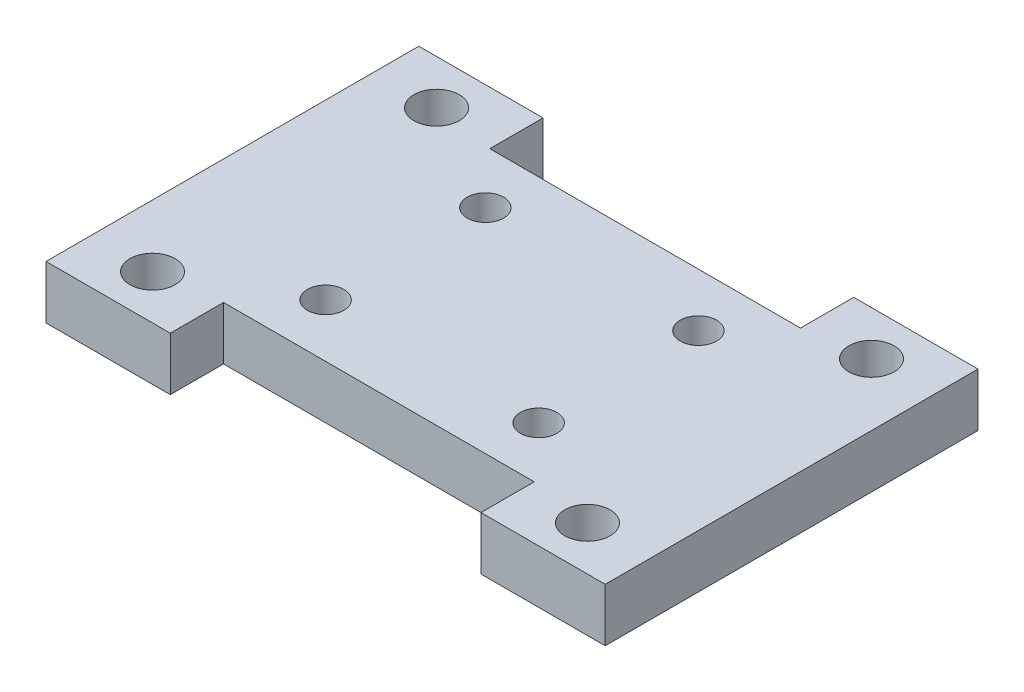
ISO-10303-21;
HEADER;
FILE_DESCRIPTION(('STEP AP214'),'2;1');
FILE_NAME('part.step','',(''),(''),'','','');
FILE_SCHEMA(('AUTOMOTIVE_DESIGN { 1 0 10303 214 1 1 1 1 }'));
ENDSEC;
DATA;
#1=APPLICATION_CONTEXT('core data for automotive mechanical design processes');
#2=APPLICATION_PROTOCOL_DEFINITION('international standard','automotive_design',2000,#1);
#3=PRODUCT_CONTEXT('',#1,'mechanical');
#4=PRODUCT('Part','Part','',(#3));
#5=PRODUCT_RELATED_PRODUCT_CATEGORY('part','',(#4));
#6=PRODUCT_DEFINITION_FORMATION('','',#4);
#7=PRODUCT_DEFINITION_CONTEXT('part definition',#1,'design');
#8=PRODUCT_DEFINITION('design','',#6,#7);
#9=PRODUCT_DEFINITION_SHAPE('','',#8);
#10=(LENGTH_UNIT() NAMED_UNIT(*) SI_UNIT(.MILLI.,.METRE.));
#11=(NAMED_UNIT(*) PLANE_ANGLE_UNIT() SI_UNIT($,.RADIAN.));
#12=(NAMED_UNIT(*) SI_UNIT($,.STERADIAN.) SOLID_ANGLE_UNIT());
#13=UNCERTAINTY_MEASURE_WITH_UNIT(LENGTH_MEASURE(1.E-05),#10,'distance_accuracy_value','');
#14=(GEOMETRIC_REPRESENTATION_CONTEXT(3) GLOBAL_UNCERTAINTY_ASSIGNED_CONTEXT((#13)) GLOBAL_UNIT_ASSIGNED_CONTEXT((#10,
#11,#12)) REPRESENTATION_CONTEXT('',''));
#15=CARTESIAN_POINT('',(0.,0.,0.));
#16=DIRECTION('',(0.,0.,1.));
#17=DIRECTION('',(1.,0.,0.));
#18=AXIS2_PLACEMENT_3D('',#15,#16,#17);
#19=CARTESIAN_POINT('',(0.,6.,0.));
#20=DIRECTION('',(0.,-1.,0.));
#21=DIRECTION('',(0.,0.,-1.));
#22=AXIS2_PLACEMENT_3D('',#19,#20,#21);
#23=PLANE('',#22);
#24=DIRECTION('',(0.,0.,1.));
#25=VECTOR('',#24,1.);
#26=CARTESIAN_POINT('',(17.5,6.,-15.));
#27=LINE('',#26,#25);
#28=CARTESIAN_POINT('',(17.5,6.,-21.));
#29=VERTEX_POINT('',#28);
#30=CARTESIAN_POINT('',(17.5,6.,-15.));
#31=VERTEX_POINT('',#30);
#32=EDGE_CURVE('E185',#29,#31,#27,.T.);
#33=ORIENTED_EDGE('',*,*,#32,.T.);
#34=DIRECTION('',(-1.,0.,0.));
#35=VECTOR('',#34,1.);
#36=CARTESIAN_POINT('',(-17.5,6.,-15.));
#37=LINE('',#36,#35);
#38=CARTESIAN_POINT('',(-17.5,6.,-15.));
#39=VERTEX_POINT('',#38);
#40=EDGE_CURVE('E113',#31,#39,#37,.T.);
#41=ORIENTED_EDGE('',*,*,#40,.T.);
#42=DIRECTION('',(0.,0.,-1.));
#43=VECTOR('',#42,1.);
#44=CARTESIAN_POINT('',(-17.5,6.,-15.));
#45=LINE('',#44,#43);
#46=CARTESIAN_POINT('',(-17.5,6.,-21.));
#47=VERTEX_POINT('',#46);
#48=EDGE_CURVE('E212',#39,#47,#45,.T.);
#49=ORIENTED_EDGE('',*,*,#48,.T.);
#50=DIRECTION('',(-1.,0.,0.));
#51=VECTOR('',#50,1.);
#52=CARTESIAN_POINT('',(-17.5,6.,-21.));
#53=LINE('',#52,#51);
#54=CARTESIAN_POINT('',(-31.5,6.,-21.));
#55=VERTEX_POINT('',#54);
#56=EDGE_CURVE('E231',#47,#55,#53,.T.);
#57=ORIENTED_EDGE('',*,*,#56,.T.);
#58=DIRECTION('',(0.,0.,1.));
#59=VECTOR('',#58,1.);
#60=CARTESIAN_POINT('',(-31.5,6.,-21.));
#61=LINE('',#60,#59);
#62=CARTESIAN_POINT('',(-31.5,6.,21.));
#63=VERTEX_POINT('',#62);
#64=EDGE_CURVE('E228',#55,#63,#61,.T.);
#65=ORIENTED_EDGE('',*,*,#64,.T.);
#66=DIRECTION('',(1.,0.,0.));
#67=VECTOR('',#66,1.);
#68=CARTESIAN_POINT('',(-31.5,6.,21.));
#69=LINE('',#68,#67);
#70=CARTESIAN_POINT('',(-17.5,6.,21.));
#71=VERTEX_POINT('',#70);
#72=EDGE_CURVE('E230',#63,#71,#69,.T.);
#73=ORIENTED_EDGE('',*,*,#72,.T.);
#74=DIRECTION('',(0.,0.,-1.));
#75=VECTOR('',#74,1.);
#76=CARTESIAN_POINT('',(-17.5,6.,21.));
#77=LINE('',#76,#75);
#78=CARTESIAN_POINT('',(-17.5,6.,15.));
#79=VERTEX_POINT('',#78);
#80=EDGE_CURVE('E233',#71,#79,#77,.T.);
#81=ORIENTED_EDGE('',*,*,#80,.T.);
#82=DIRECTION('',(1.,0.,0.));
#83=VECTOR('',#82,1.);
#84=CARTESIAN_POINT('',(-17.5,6.,15.));
#85=LINE('',#84,#83);
#86=CARTESIAN_POINT('',(17.5,6.,15.));
#87=VERTEX_POINT('',#86);
#88=EDGE_CURVE('E239',#79,#87,#85,.T.);
#89=ORIENTED_EDGE('',*,*,#88,.T.);
#90=DIRECTION('',(0.,0.,1.));
#91=VECTOR('',#90,1.);
#92=CARTESIAN_POINT('',(17.5,6.,21.));
#93=LINE('',#92,#91);
#94=CARTESIAN_POINT('',(17.5,6.,21.));
#95=VERTEX_POINT('',#94);
#96=EDGE_CURVE('E144',#87,#95,#93,.T.);
#97=ORIENTED_EDGE('',*,*,#96,.T.);
#98=DIRECTION('',(1.,0.,0.));
#99=VECTOR('',#98,1.);
#100=CARTESIAN_POINT('',(31.5,6.,21.));
#101=LINE('',#100,#99);
#102=CARTESIAN_POINT('',(31.5,6.,21.));
#103=VERTEX_POINT('',#102);
#104=EDGE_CURVE('E138',#95,#103,#101,.T.);
#105=ORIENTED_EDGE('',*,*,#104,.T.);
#106=DIRECTION('',(0.,0.,-1.));
#107=VECTOR('',#106,1.);
#108=CARTESIAN_POINT('',(31.5,6.,-21.));
#109=LINE('',#108,#107);
#110=CARTESIAN_POINT('',(31.5,6.,-21.));
#111=VERTEX_POINT('',#110);
#112=EDGE_CURVE('E142',#103,#111,#109,.T.);
#113=ORIENTED_EDGE('',*,*,#112,.T.);
#114=DIRECTION('',(-1.,0.,0.));
#115=VECTOR('',#114,1.);
#116=CARTESIAN_POINT('',(17.5,6.,-21.));
#117=LINE('',#116,#115);
#118=EDGE_CURVE('E58',#111,#29,#117,.T.);
#119=ORIENTED_EDGE('',*,*,#118,.T.);
#120=EDGE_LOOP('',(#33,#41,#49,#57,#65,#73,#81,#89,#97,#105,#113,#119));
#121=FACE_BOUND('',#120,.T.);
#122=CARTESIAN_POINT('',(-12.,6.,-9.));
#123=DIRECTION('',(0.,1.,0.));
#124=DIRECTION('',(0.,0.,1.));
#125=AXIS2_PLACEMENT_3D('',#122,#123,#124);
#126=CIRCLE('',#125,2.05);
#127=CARTESIAN_POINT('',(-12.,6.,-6.95));
#128=VERTEX_POINT('',#127);
#129=EDGE_CURVE('E166',#128,#128,#126,.T.);
#130=ORIENTED_EDGE('',*,*,#129,.F.);
#131=EDGE_LOOP('',(#130));
#132=FACE_BOUND('',#131,.T.);
#133=CARTESIAN_POINT('',(12.,6.,-9.));
#134=DIRECTION('',(0.,1.,0.));
#135=DIRECTION('',(0.,0.,-1.));
#136=AXIS2_PLACEMENT_3D('',#133,#134,#135);
#137=CIRCLE('',#136,2.05);
#138=CARTESIAN_POINT('',(12.,6.,-11.05));
#139=VERTEX_POINT('',#138);
#140=EDGE_CURVE('E343',#139,#139,#137,.T.);
#141=ORIENTED_EDGE('',*,*,#140,.F.);
#142=EDGE_LOOP('',(#141));
#143=FACE_BOUND('',#142,.T.);
#144=CARTESIAN_POINT('',(12.,6.,9.00000000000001));
#145=DIRECTION('',(0.,1.,0.));
#146=DIRECTION('',(0.,0.,1.));
#147=AXIS2_PLACEMENT_3D('',#144,#145,#146);
#148=CIRCLE('',#147,2.05);
#149=CARTESIAN_POINT('',(12.,6.,11.05));
#150=VERTEX_POINT('',#149);
#151=EDGE_CURVE('E337',#150,#150,#148,.T.);
#152=ORIENTED_EDGE('',*,*,#151,.F.);
#153=EDGE_LOOP('',(#152));
#154=FACE_BOUND('',#153,.T.);
#155=CARTESIAN_POINT('',(-12.,6.,9.));
#156=DIRECTION('',(0.,1.,0.));
#157=DIRECTION('',(0.,0.,-1.));
#158=AXIS2_PLACEMENT_3D('',#155,#156,#157);
#159=CIRCLE('',#158,2.05);
#160=CARTESIAN_POINT('',(-12.,6.,6.95));
#161=VERTEX_POINT('',#160);
#162=EDGE_CURVE('E331',#161,#161,#159,.T.);
#163=ORIENTED_EDGE('',*,*,#162,.F.);
#164=EDGE_LOOP('',(#163));
#165=FACE_BOUND('',#164,.T.);
#166=CARTESIAN_POINT('',(24.5,6.,-16.));
#167=DIRECTION('',(0.,1.,0.));
#168=DIRECTION('',(0.,0.,1.));
#169=AXIS2_PLACEMENT_3D('',#166,#167,#168);
#170=CIRCLE('',#169,2.55);
#171=CARTESIAN_POINT('',(24.5,6.,-13.45));
#172=VERTEX_POINT('',#171);
#173=EDGE_CURVE('E325',#172,#172,#170,.T.);
#174=ORIENTED_EDGE('',*,*,#173,.F.);
#175=EDGE_LOOP('',(#174));
#176=FACE_BOUND('',#175,.T.);
#177=CARTESIAN_POINT('',(24.5,6.,16.));
#178=DIRECTION('',(0.,1.,0.));
#179=DIRECTION('',(0.,0.,-1.));
#180=AXIS2_PLACEMENT_3D('',#177,#178,#179);
#181=CIRCLE('',#180,2.55);
#182=CARTESIAN_POINT('',(24.5,6.,13.45));
#183=VERTEX_POINT('',#182);
#184=EDGE_CURVE('E319',#183,#183,#181,.T.);
#185=ORIENTED_EDGE('',*,*,#184,.F.);
#186=EDGE_LOOP('',(#185));
#187=FACE_BOUND('',#186,.T.);
#188=CARTESIAN_POINT('',(-24.5,6.,16.));
#189=DIRECTION('',(0.,1.,0.));
#190=DIRECTION('',(0.,0.,1.));
#191=AXIS2_PLACEMENT_3D('',#188,#189,#190);
#192=CIRCLE('',#191,2.55);
#193=CARTESIAN_POINT('',(-24.5,6.,18.55));
#194=VERTEX_POINT('',#193);
#195=EDGE_CURVE('E313',#194,#194,#192,.T.);
#196=ORIENTED_EDGE('',*,*,#195,.F.);
#197=EDGE_LOOP('',(#196));
#198=FACE_BOUND('',#197,.T.);
#199=CARTESIAN_POINT('',(-24.5,6.,-16.));
#200=DIRECTION('',(0.,1.,0.));
#201=DIRECTION('',(0.,0.,-1.));
#202=AXIS2_PLACEMENT_3D('',#199,#200,#201);
#203=CIRCLE('',#202,2.55);
#204=CARTESIAN_POINT('',(-24.5,6.,-18.55));
#205=VERTEX_POINT('',#204);
#206=EDGE_CURVE('E304',#205,#205,#203,.T.);
#207=ORIENTED_EDGE('',*,*,#206,.F.);
#208=EDGE_LOOP('',(#207));
#209=FACE_BOUND('',#208,.T.);
#210=ADVANCED_FACE('F41',(#121,#132,#143,#154,#165,#176,#187,#198,#209),#23,.F.);
#211=CARTESIAN_POINT('',(0.,0.,0.));
#212=DIRECTION('',(0.,-1.,0.));
#213=DIRECTION('',(0.,0.,-1.));
#214=AXIS2_PLACEMENT_3D('',#211,#212,#213);
#215=PLANE('',#214);
#216=CARTESIAN_POINT('',(-24.5,0.,16.));
#217=DIRECTION('',(0.,1.,0.));
#218=DIRECTION('',(0.,0.,1.));
#219=AXIS2_PLACEMENT_3D('',#216,#217,#218);
#220=CIRCLE('',#219,2.55);
#221=CARTESIAN_POINT('',(-24.5,0.,18.55));
#222=VERTEX_POINT('',#221);
#223=EDGE_CURVE('E310',#222,#222,#220,.T.);
#224=ORIENTED_EDGE('',*,*,#223,.T.);
#225=EDGE_LOOP('',(#224));
#226=FACE_BOUND('',#225,.T.);
#227=CARTESIAN_POINT('',(24.5,0.,-16.));
#228=DIRECTION('',(0.,1.,0.));
#229=DIRECTION('',(0.,0.,1.));
#230=AXIS2_PLACEMENT_3D('',#227,#228,#229);
#231=CIRCLE('',#230,2.55);
#232=CARTESIAN_POINT('',(24.5,0.,-13.45));
#233=VERTEX_POINT('',#232);
#234=EDGE_CURVE('E322',#233,#233,#231,.T.);
#235=ORIENTED_EDGE('',*,*,#234,.T.);
#236=EDGE_LOOP('',(#235));
#237=FACE_BOUND('',#236,.T.);
#238=CARTESIAN_POINT('',(12.,0.,9.00000000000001));
#239=DIRECTION('',(0.,1.,0.));
#240=DIRECTION('',(0.,0.,1.));
#241=AXIS2_PLACEMENT_3D('',#238,#239,#240);
#242=CIRCLE('',#241,2.05);
#243=CARTESIAN_POINT('',(12.,0.,11.05));
#244=VERTEX_POINT('',#243);
#245=EDGE_CURVE('E334',#244,#244,#242,.T.);
#246=ORIENTED_EDGE('',*,*,#245,.T.);
#247=EDGE_LOOP('',(#246));
#248=FACE_BOUND('',#247,.T.);
#249=CARTESIAN_POINT('',(-12.,0.,-9.));
#250=DIRECTION('',(0.,1.,0.));
#251=DIRECTION('',(0.,0.,1.));
#252=AXIS2_PLACEMENT_3D('',#249,#250,#251);
#253=CIRCLE('',#252,2.05);
#254=CARTESIAN_POINT('',(-12.,0.,-6.95));
#255=VERTEX_POINT('',#254);
#256=EDGE_CURVE('E346',#255,#255,#253,.T.);
#257=ORIENTED_EDGE('',*,*,#256,.T.);
#258=EDGE_LOOP('',(#257));
#259=FACE_BOUND('',#258,.T.);
#260=DIRECTION('',(0.,0.,1.));
#261=VECTOR('',#260,1.);
#262=CARTESIAN_POINT('',(17.5,0.,-15.));
#263=LINE('',#262,#261);
#264=CARTESIAN_POINT('',(17.5,0.,-21.));
#265=VERTEX_POINT('',#264);
#266=CARTESIAN_POINT('',(17.5,0.,-15.));
#267=VERTEX_POINT('',#266);
#268=EDGE_CURVE('E162',#265,#267,#263,.T.);
#269=ORIENTED_EDGE('',*,*,#268,.F.);
#270=DIRECTION('',(-1.,0.,0.));
#271=VECTOR('',#270,1.);
#272=CARTESIAN_POINT('',(17.5,0.,-21.));
#273=LINE('',#272,#271);
#274=CARTESIAN_POINT('',(31.5,0.,-21.));
#275=VERTEX_POINT('',#274);
#276=EDGE_CURVE('E105',#275,#265,#273,.T.);
#277=ORIENTED_EDGE('',*,*,#276,.F.);
#278=DIRECTION('',(0.,0.,-1.));
#279=VECTOR('',#278,1.);
#280=CARTESIAN_POINT('',(31.5,0.,-21.));
#281=LINE('',#280,#279);
#282=CARTESIAN_POINT('',(31.5,0.,21.));
#283=VERTEX_POINT('',#282);
#284=EDGE_CURVE('E99',#283,#275,#281,.T.);
#285=ORIENTED_EDGE('',*,*,#284,.F.);
#286=DIRECTION('',(1.,0.,0.));
#287=VECTOR('',#286,1.);
#288=CARTESIAN_POINT('',(31.5,0.,21.));
#289=LINE('',#288,#287);
#290=CARTESIAN_POINT('',(17.5,0.,21.));
#291=VERTEX_POINT('',#290);
#292=EDGE_CURVE('E152',#291,#283,#289,.T.);
#293=ORIENTED_EDGE('',*,*,#292,.F.);
#294=DIRECTION('',(0.,0.,1.));
#295=VECTOR('',#294,1.);
#296=CARTESIAN_POINT('',(17.5,0.,21.));
#297=LINE('',#296,#295);
#298=CARTESIAN_POINT('',(17.5,0.,15.));
#299=VERTEX_POINT('',#298);
#300=EDGE_CURVE('E180',#299,#291,#297,.T.);
#301=ORIENTED_EDGE('',*,*,#300,.F.);
#302=DIRECTION('',(1.,0.,0.));
#303=VECTOR('',#302,1.);
#304=CARTESIAN_POINT('',(-17.5,0.,15.));
#305=LINE('',#304,#303);
#306=CARTESIAN_POINT('',(-17.5,0.,15.));
#307=VERTEX_POINT('',#306);
#308=EDGE_CURVE('E178',#307,#299,#305,.T.);
#309=ORIENTED_EDGE('',*,*,#308,.F.);
#310=DIRECTION('',(0.,0.,-1.));
#311=VECTOR('',#310,1.);
#312=CARTESIAN_POINT('',(-17.5,0.,21.));
#313=LINE('',#312,#311);
#314=CARTESIAN_POINT('',(-17.5,0.,21.));
#315=VERTEX_POINT('',#314);
#316=EDGE_CURVE('E176',#315,#307,#313,.T.);
#317=ORIENTED_EDGE('',*,*,#316,.F.);
#318=DIRECTION('',(1.,0.,0.));
#319=VECTOR('',#318,1.);
#320=CARTESIAN_POINT('',(-31.5,0.,21.));
#321=LINE('',#320,#319);
#322=CARTESIAN_POINT('',(-31.5,0.,21.));
#323=VERTEX_POINT('',#322);
#324=EDGE_CURVE('E174',#323,#315,#321,.T.);
#325=ORIENTED_EDGE('',*,*,#324,.F.);
#326=DIRECTION('',(0.,0.,1.));
#327=VECTOR('',#326,1.);
#328=CARTESIAN_POINT('',(-31.5,0.,-21.));
#329=LINE('',#328,#327);
#330=CARTESIAN_POINT('',(-31.5,0.,-21.));
#331=VERTEX_POINT('',#330);
#332=EDGE_CURVE('E172',#331,#323,#329,.T.);
#333=ORIENTED_EDGE('',*,*,#332,.F.);
#334=DIRECTION('',(-1.,0.,0.));
#335=VECTOR('',#334,1.);
#336=CARTESIAN_POINT('',(-17.5,0.,-21.));
#337=LINE('',#336,#335);
#338=CARTESIAN_POINT('',(-17.5,0.,-21.));
#339=VERTEX_POINT('',#338);
#340=EDGE_CURVE('E170',#339,#331,#337,.T.);
#341=ORIENTED_EDGE('',*,*,#340,.F.);
#342=DIRECTION('',(0.,0.,-1.));
#343=VECTOR('',#342,1.);
#344=CARTESIAN_POINT('',(-17.5,0.,-15.));
#345=LINE('',#344,#343);
#346=CARTESIAN_POINT('',(-17.5,0.,-15.));
#347=VERTEX_POINT('',#346);
#348=EDGE_CURVE('E168',#347,#339,#345,.T.);
#349=ORIENTED_EDGE('',*,*,#348,.F.);
#350=DIRECTION('',(-1.,0.,0.));
#351=VECTOR('',#350,1.);
#352=CARTESIAN_POINT('',(-17.5,0.,-15.));
#353=LINE('',#352,#351);
#354=EDGE_CURVE('E165',#267,#347,#353,.T.);
#355=ORIENTED_EDGE('',*,*,#354,.F.);
#356=EDGE_LOOP('',(#269,#277,#285,#293,#301,#309,#317,#325,#333,#341,#349,#355));
#357=FACE_BOUND('',#356,.T.);
#358=CARTESIAN_POINT('',(12.,0.,-9.));
#359=DIRECTION('',(0.,1.,0.));
#360=DIRECTION('',(0.,0.,-1.));
#361=AXIS2_PLACEMENT_3D('',#358,#359,#360);
#362=CIRCLE('',#361,2.05);
#363=CARTESIAN_POINT('',(12.,0.,-11.05));
#364=VERTEX_POINT('',#363);
#365=EDGE_CURVE('E340',#364,#364,#362,.T.);
#366=ORIENTED_EDGE('',*,*,#365,.T.);
#367=EDGE_LOOP('',(#366));
#368=FACE_BOUND('',#367,.T.);
#369=CARTESIAN_POINT('',(-12.,0.,9.));
#370=DIRECTION('',(0.,1.,0.));
#371=DIRECTION('',(0.,0.,-1.));
#372=AXIS2_PLACEMENT_3D('',#369,#370,#371);
#373=CIRCLE('',#372,2.05);
#374=CARTESIAN_POINT('',(-12.,0.,6.95));
#375=VERTEX_POINT('',#374);
#376=EDGE_CURVE('E328',#375,#375,#373,.T.);
#377=ORIENTED_EDGE('',*,*,#376,.T.);
#378=EDGE_LOOP('',(#377));
#379=FACE_BOUND('',#378,.T.);
#380=CARTESIAN_POINT('',(24.5,0.,16.));
#381=DIRECTION('',(0.,1.,0.));
#382=DIRECTION('',(0.,0.,-1.));
#383=AXIS2_PLACEMENT_3D('',#380,#381,#382);
#384=CIRCLE('',#383,2.55);
#385=CARTESIAN_POINT('',(24.5,0.,13.45));
#386=VERTEX_POINT('',#385);
#387=EDGE_CURVE('E316',#386,#386,#384,.T.);
#388=ORIENTED_EDGE('',*,*,#387,.T.);
#389=EDGE_LOOP('',(#388));
#390=FACE_BOUND('',#389,.T.);
#391=CARTESIAN_POINT('',(-24.5,0.,-16.));
#392=DIRECTION('',(0.,1.,0.));
#393=DIRECTION('',(0.,0.,-1.));
#394=AXIS2_PLACEMENT_3D('',#391,#392,#393);
#395=CIRCLE('',#394,2.55);
#396=CARTESIAN_POINT('',(-24.5,0.,-18.55));
#397=VERTEX_POINT('',#396);
#398=EDGE_CURVE('E307',#397,#397,#395,.T.);
#399=ORIENTED_EDGE('',*,*,#398,.T.);
#400=EDGE_LOOP('',(#399));
#401=FACE_BOUND('',#400,.T.);
#402=ADVANCED_FACE('F216',(#226,#237,#248,#259,#357,#368,#379,#390,#401),#215,.T.);
#403=CARTESIAN_POINT('',(17.5,6.,-15.));
#404=DIRECTION('',(1.,0.,0.));
#405=DIRECTION('',(0.,0.,-1.));
#406=AXIS2_PLACEMENT_3D('',#403,#404,#405);
#407=PLANE('',#406);
#408=ORIENTED_EDGE('',*,*,#268,.T.);
#409=DIRECTION('',(0.,-1.,0.));
#410=VECTOR('',#409,1.);
#411=CARTESIAN_POINT('',(17.5,6.,-15.));
#412=LINE('',#411,#410);
#413=EDGE_CURVE('E11',#31,#267,#412,.T.);
#414=ORIENTED_EDGE('',*,*,#413,.F.);
#415=ORIENTED_EDGE('',*,*,#32,.F.);
#416=DIRECTION('',(0.,-1.,0.));
#417=VECTOR('',#416,1.);
#418=CARTESIAN_POINT('',(17.5,6.,-21.));
#419=LINE('',#418,#417);
#420=EDGE_CURVE('E158',#29,#265,#419,.T.);
#421=ORIENTED_EDGE('',*,*,#420,.T.);
#422=EDGE_LOOP('',(#408,#414,#415,#421));
#423=FACE_BOUND('',#422,.T.);
#424=ADVANCED_FACE('F43',(#423),#407,.F.);
#425=CARTESIAN_POINT('',(-17.5,6.,-15.));
#426=DIRECTION('',(0.,0.,1.));
#427=DIRECTION('',(1.,0.,0.));
#428=AXIS2_PLACEMENT_3D('',#425,#426,#427);
#429=PLANE('',#428);
#430=ORIENTED_EDGE('',*,*,#354,.T.);
#431=DIRECTION('',(0.,-1.,0.));
#432=VECTOR('',#431,1.);
#433=CARTESIAN_POINT('',(-17.5,6.,-15.));
#434=LINE('',#433,#432);
#435=EDGE_CURVE('E50',#39,#347,#434,.T.);
#436=ORIENTED_EDGE('',*,*,#435,.F.);
#437=ORIENTED_EDGE('',*,*,#40,.F.);
#438=ORIENTED_EDGE('',*,*,#413,.T.);
#439=EDGE_LOOP('',(#430,#436,#437,#438));
#440=FACE_BOUND('',#439,.T.);
#441=ADVANCED_FACE('F502',(#440),#429,.F.);
#442=CARTESIAN_POINT('',(-17.5,6.,-15.));
#443=DIRECTION('',(-1.,0.,0.));
#444=DIRECTION('',(0.,0.,1.));
#445=AXIS2_PLACEMENT_3D('',#442,#443,#444);
#446=PLANE('',#445);
#447=ORIENTED_EDGE('',*,*,#348,.T.);
#448=DIRECTION('',(0.,-1.,0.));
#449=VECTOR('',#448,1.);
#450=CARTESIAN_POINT('',(-17.5,6.,-21.));
#451=LINE('',#450,#449);
#452=EDGE_CURVE('E204',#47,#339,#451,.T.);
#453=ORIENTED_EDGE('',*,*,#452,.F.);
#454=ORIENTED_EDGE('',*,*,#48,.F.);
#455=ORIENTED_EDGE('',*,*,#435,.T.);
#456=EDGE_LOOP('',(#447,#453,#454,#455));
#457=FACE_BOUND('',#456,.T.);
#458=ADVANCED_FACE('F210',(#457),#446,.F.);
#459=CARTESIAN_POINT('',(-17.5,6.,-21.));
#460=DIRECTION('',(0.,0.,1.));
#461=DIRECTION('',(1.,0.,0.));
#462=AXIS2_PLACEMENT_3D('',#459,#460,#461);
#463=PLANE('',#462);
#464=ORIENTED_EDGE('',*,*,#340,.T.);
#465=DIRECTION('',(0.,-1.,0.));
#466=VECTOR('',#465,1.);
#467=CARTESIAN_POINT('',(-31.5,6.,-21.));
#468=LINE('',#467,#466);
#469=EDGE_CURVE('E201',#55,#331,#468,.T.);
#470=ORIENTED_EDGE('',*,*,#469,.F.);
#471=ORIENTED_EDGE('',*,*,#56,.F.);
#472=ORIENTED_EDGE('',*,*,#452,.T.);
#473=EDGE_LOOP('',(#464,#470,#471,#472));
#474=FACE_BOUND('',#473,.T.);
#475=ADVANCED_FACE('F222',(#474),#463,.F.);
#476=CARTESIAN_POINT('',(-31.5,6.,-21.));
#477=DIRECTION('',(1.,0.,0.));
#478=DIRECTION('',(0.,0.,-1.));
#479=AXIS2_PLACEMENT_3D('',#476,#477,#478);
#480=PLANE('',#479);
#481=ORIENTED_EDGE('',*,*,#332,.T.);
#482=DIRECTION('',(0.,-1.,0.));
#483=VECTOR('',#482,1.);
#484=CARTESIAN_POINT('',(-31.5,6.,21.));
#485=LINE('',#484,#483);
#486=EDGE_CURVE('E198',#63,#323,#485,.T.);
#487=ORIENTED_EDGE('',*,*,#486,.F.);
#488=ORIENTED_EDGE('',*,*,#64,.F.);
#489=ORIENTED_EDGE('',*,*,#469,.T.);
#490=EDGE_LOOP('',(#481,#487,#488,#489));
#491=FACE_BOUND('',#490,.T.);
#492=ADVANCED_FACE('F226',(#491),#480,.F.);
#493=CARTESIAN_POINT('',(-31.5,6.,21.));
#494=DIRECTION('',(0.,0.,-1.));
#495=DIRECTION('',(-1.,0.,0.));
#496=AXIS2_PLACEMENT_3D('',#493,#494,#495);
#497=PLANE('',#496);
#498=ORIENTED_EDGE('',*,*,#324,.T.);
#499=DIRECTION('',(0.,-1.,0.));
#500=VECTOR('',#499,1.);
#501=CARTESIAN_POINT('',(-17.5,6.,21.));
#502=LINE('',#501,#500);
#503=EDGE_CURVE('E195',#71,#315,#502,.T.);
#504=ORIENTED_EDGE('',*,*,#503,.F.);
#505=ORIENTED_EDGE('',*,*,#72,.F.);
#506=ORIENTED_EDGE('',*,*,#486,.T.);
#507=EDGE_LOOP('',(#498,#504,#505,#506));
#508=FACE_BOUND('',#507,.T.);
#509=ADVANCED_FACE('F467',(#508),#497,.F.);
#510=CARTESIAN_POINT('',(-17.5,6.,21.));
#511=DIRECTION('',(-1.,0.,0.));
#512=DIRECTION('',(0.,0.,1.));
#513=AXIS2_PLACEMENT_3D('',#510,#511,#512);
#514=PLANE('',#513);
#515=ORIENTED_EDGE('',*,*,#316,.T.);
#516=DIRECTION('',(0.,-1.,0.));
#517=VECTOR('',#516,1.);
#518=CARTESIAN_POINT('',(-17.5,6.,15.));
#519=LINE('',#518,#517);
#520=EDGE_CURVE('E192',#79,#307,#519,.T.);
#521=ORIENTED_EDGE('',*,*,#520,.F.);
#522=ORIENTED_EDGE('',*,*,#80,.F.);
#523=ORIENTED_EDGE('',*,*,#503,.T.);
#524=EDGE_LOOP('',(#515,#521,#522,#523));
#525=FACE_BOUND('',#524,.T.);
#526=ADVANCED_FACE('F458',(#525),#514,.F.);
#527=CARTESIAN_POINT('',(-17.5,6.,15.));
#528=DIRECTION('',(0.,0.,-1.));
#529=DIRECTION('',(-1.,0.,0.));
#530=AXIS2_PLACEMENT_3D('',#527,#528,#529);
#531=PLANE('',#530);
#532=ORIENTED_EDGE('',*,*,#308,.T.);
#533=DIRECTION('',(0.,-1.,0.));
#534=VECTOR('',#533,1.);
#535=CARTESIAN_POINT('',(17.5,6.,15.));
#536=LINE('',#535,#534);
#537=EDGE_CURVE('E189',#87,#299,#536,.T.);
#538=ORIENTED_EDGE('',*,*,#537,.F.);
#539=ORIENTED_EDGE('',*,*,#88,.F.);
#540=ORIENTED_EDGE('',*,*,#520,.T.);
#541=EDGE_LOOP('',(#532,#538,#539,#540));
#542=FACE_BOUND('',#541,.T.);
#543=ADVANCED_FACE('F245',(#542),#531,.F.);
#544=CARTESIAN_POINT('',(17.5,6.,21.));
#545=DIRECTION('',(1.,0.,0.));
#546=DIRECTION('',(0.,0.,-1.));
#547=AXIS2_PLACEMENT_3D('',#544,#545,#546);
#548=PLANE('',#547);
#549=ORIENTED_EDGE('',*,*,#300,.T.);
#550=DIRECTION('',(0.,-1.,0.));
#551=VECTOR('',#550,1.);
#552=CARTESIAN_POINT('',(17.5,6.,21.));
#553=LINE('',#552,#551);
#554=EDGE_CURVE('E153',#95,#291,#553,.T.);
#555=ORIENTED_EDGE('',*,*,#554,.F.);
#556=ORIENTED_EDGE('',*,*,#96,.F.);
#557=ORIENTED_EDGE('',*,*,#537,.T.);
#558=EDGE_LOOP('',(#549,#555,#556,#557));
#559=FACE_BOUND('',#558,.T.);
#560=ADVANCED_FACE('F249',(#559),#548,.F.);
#561=CARTESIAN_POINT('',(31.5,6.,21.));
#562=DIRECTION('',(0.,0.,-1.));
#563=DIRECTION('',(-1.,0.,0.));
#564=AXIS2_PLACEMENT_3D('',#561,#562,#563);
#565=PLANE('',#564);
#566=ORIENTED_EDGE('',*,*,#292,.T.);
#567=DIRECTION('',(0.,-1.,0.));
#568=VECTOR('',#567,1.);
#569=CARTESIAN_POINT('',(31.5,6.,21.));
#570=LINE('',#569,#568);
#571=EDGE_CURVE('E149',#103,#283,#570,.T.);
#572=ORIENTED_EDGE('',*,*,#571,.F.);
#573=ORIENTED_EDGE('',*,*,#104,.F.);
#574=ORIENTED_EDGE('',*,*,#554,.T.);
#575=EDGE_LOOP('',(#566,#572,#573,#574));
#576=FACE_BOUND('',#575,.T.);
#577=ADVANCED_FACE('F150',(#576),#565,.F.);
#578=CARTESIAN_POINT('',(31.5,6.,-21.));
#579=DIRECTION('',(-1.,0.,0.));
#580=DIRECTION('',(0.,0.,1.));
#581=AXIS2_PLACEMENT_3D('',#578,#579,#580);
#582=PLANE('',#581);
#583=ORIENTED_EDGE('',*,*,#284,.T.);
#584=DIRECTION('',(0.,-1.,0.));
#585=VECTOR('',#584,1.);
#586=CARTESIAN_POINT('',(31.5,6.,-21.));
#587=LINE('',#586,#585);
#588=EDGE_CURVE('E154',#111,#275,#587,.T.);
#589=ORIENTED_EDGE('',*,*,#588,.F.);
#590=ORIENTED_EDGE('',*,*,#112,.F.);
#591=ORIENTED_EDGE('',*,*,#571,.T.);
#592=EDGE_LOOP('',(#583,#589,#590,#591));
#593=FACE_BOUND('',#592,.T.);
#594=ADVANCED_FACE('F156',(#593),#582,.F.);
#595=CARTESIAN_POINT('',(17.5,6.,-21.));
#596=DIRECTION('',(0.,0.,1.));
#597=DIRECTION('',(1.,0.,0.));
#598=AXIS2_PLACEMENT_3D('',#595,#596,#597);
#599=PLANE('',#598);
#600=ORIENTED_EDGE('',*,*,#276,.T.);
#601=ORIENTED_EDGE('',*,*,#420,.F.);
#602=ORIENTED_EDGE('',*,*,#118,.F.);
#603=ORIENTED_EDGE('',*,*,#588,.T.);
#604=EDGE_LOOP('',(#600,#601,#602,#603));
#605=FACE_BOUND('',#604,.T.);
#606=ADVANCED_FACE('F253',(#605),#599,.F.);
#607=CARTESIAN_POINT('',(-12.,6.,-9.));
#608=DIRECTION('',(0.,-1.,0.));
#609=DIRECTION('',(0.,0.,-1.));
#610=AXIS2_PLACEMENT_3D('',#607,#608,#609);
#611=CYLINDRICAL_SURFACE('',#610,2.05);
#612=ORIENTED_EDGE('',*,*,#129,.T.);
#613=EDGE_LOOP('',(#612));
#614=FACE_BOUND('',#613,.T.);
#615=ORIENTED_EDGE('',*,*,#256,.F.);
#616=EDGE_LOOP('',(#615));
#617=FACE_BOUND('',#616,.T.);
#618=ADVANCED_FACE('F255',(#614,#617),#611,.F.);
#619=CARTESIAN_POINT('',(12.,6.,-9.));
#620=DIRECTION('',(0.,-1.,0.));
#621=DIRECTION('',(0.,0.,-1.));
#622=AXIS2_PLACEMENT_3D('',#619,#620,#621);
#623=CYLINDRICAL_SURFACE('',#622,2.05);
#624=ORIENTED_EDGE('',*,*,#140,.T.);
#625=EDGE_LOOP('',(#624));
#626=FACE_BOUND('',#625,.T.);
#627=ORIENTED_EDGE('',*,*,#365,.F.);
#628=EDGE_LOOP('',(#627));
#629=FACE_BOUND('',#628,.T.);
#630=ADVANCED_FACE('F261',(#626,#629),#623,.F.);
#631=CARTESIAN_POINT('',(12.,6.,9.00000000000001));
#632=DIRECTION('',(0.,-1.,0.));
#633=DIRECTION('',(0.,0.,-1.));
#634=AXIS2_PLACEMENT_3D('',#631,#632,#633);
#635=CYLINDRICAL_SURFACE('',#634,2.05);
#636=ORIENTED_EDGE('',*,*,#151,.T.);
#637=EDGE_LOOP('',(#636));
#638=FACE_BOUND('',#637,.T.);
#639=ORIENTED_EDGE('',*,*,#245,.F.);
#640=EDGE_LOOP('',(#639));
#641=FACE_BOUND('',#640,.T.);
#642=ADVANCED_FACE('F275',(#638,#641),#635,.F.);
#643=CARTESIAN_POINT('',(-12.,6.,9.));
#644=DIRECTION('',(0.,-1.,0.));
#645=DIRECTION('',(0.,0.,-1.));
#646=AXIS2_PLACEMENT_3D('',#643,#644,#645);
#647=CYLINDRICAL_SURFACE('',#646,2.05);
#648=ORIENTED_EDGE('',*,*,#162,.T.);
#649=EDGE_LOOP('',(#648));
#650=FACE_BOUND('',#649,.T.);
#651=ORIENTED_EDGE('',*,*,#376,.F.);
#652=EDGE_LOOP('',(#651));
#653=FACE_BOUND('',#652,.T.);
#654=ADVANCED_FACE('F279',(#650,#653),#647,.F.);
#655=CARTESIAN_POINT('',(24.5,6.,-16.));
#656=DIRECTION('',(0.,-1.,0.));
#657=DIRECTION('',(0.,0.,-1.));
#658=AXIS2_PLACEMENT_3D('',#655,#656,#657);
#659=CYLINDRICAL_SURFACE('',#658,2.55);
#660=ORIENTED_EDGE('',*,*,#173,.T.);
#661=EDGE_LOOP('',(#660));
#662=FACE_BOUND('',#661,.T.);
#663=ORIENTED_EDGE('',*,*,#234,.F.);
#664=EDGE_LOOP('',(#663));
#665=FACE_BOUND('',#664,.T.);
#666=ADVANCED_FACE('F283',(#662,#665),#659,.F.);
#667=CARTESIAN_POINT('',(24.5,6.,16.));
#668=DIRECTION('',(0.,-1.,0.));
#669=DIRECTION('',(0.,0.,-1.));
#670=AXIS2_PLACEMENT_3D('',#667,#668,#669);
#671=CYLINDRICAL_SURFACE('',#670,2.55);
#672=ORIENTED_EDGE('',*,*,#184,.T.);
#673=EDGE_LOOP('',(#672));
#674=FACE_BOUND('',#673,.T.);
#675=ORIENTED_EDGE('',*,*,#387,.F.);
#676=EDGE_LOOP('',(#675));
#677=FACE_BOUND('',#676,.T.);
#678=ADVANCED_FACE('F287',(#674,#677),#671,.F.);
#679=CARTESIAN_POINT('',(-24.5,6.,16.));
#680=DIRECTION('',(0.,-1.,0.));
#681=DIRECTION('',(0.,0.,-1.));
#682=AXIS2_PLACEMENT_3D('',#679,#680,#681);
#683=CYLINDRICAL_SURFACE('',#682,2.55);
#684=ORIENTED_EDGE('',*,*,#195,.T.);
#685=EDGE_LOOP('',(#684));
#686=FACE_BOUND('',#685,.T.);
#687=ORIENTED_EDGE('',*,*,#223,.F.);
#688=EDGE_LOOP('',(#687));
#689=FACE_BOUND('',#688,.T.);
#690=ADVANCED_FACE('F291',(#686,#689),#683,.F.);
#691=CARTESIAN_POINT('',(-24.5,6.,-16.));
#692=DIRECTION('',(0.,-1.,0.));
#693=DIRECTION('',(0.,0.,-1.));
#694=AXIS2_PLACEMENT_3D('',#691,#692,#693);
#695=CYLINDRICAL_SURFACE('',#694,2.55);
#696=ORIENTED_EDGE('',*,*,#206,.T.);
#697=EDGE_LOOP('',(#696));
#698=FACE_BOUND('',#697,.T.);
#699=ORIENTED_EDGE('',*,*,#398,.F.);
#700=EDGE_LOOP('',(#699));
#701=FACE_BOUND('',#700,.T.);
#702=ADVANCED_FACE('F295',(#698,#701),#695,.F.);
#703=CLOSED_SHELL('',(#210,#402,#424,#441,#458,#475,#492,#509,#526,#543,#560,#577,#594,#606,
#618,#630,#642,#654,#666,#678,#690,#702));
#704=MANIFOLD_SOLID_BREP('B2',#703);
#705=ADVANCED_BREP_SHAPE_REPRESENTATION('',(#18,#704),#14);
#706=SHAPE_DEFINITION_REPRESENTATION(#9,#705);
ENDSEC;
END-ISO-10303-21;
